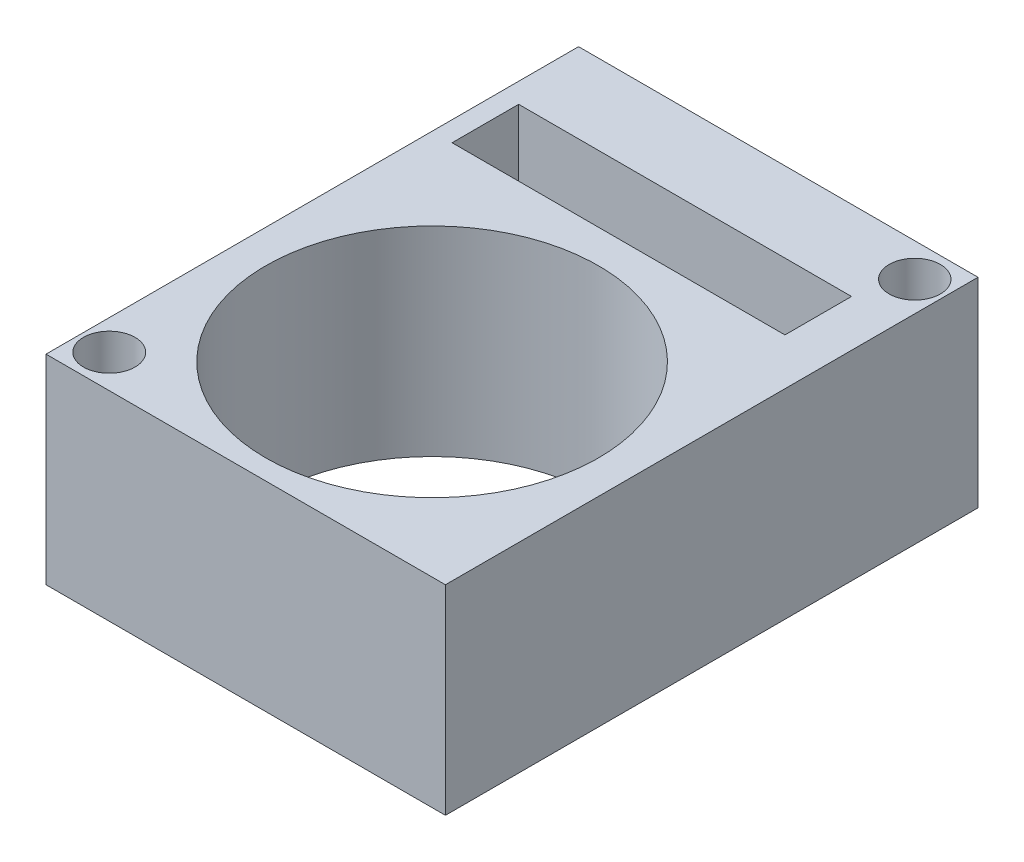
ISO-10303-21;
HEADER;
FILE_DESCRIPTION(('STEP AP214'),'2;1');
FILE_NAME('part.step','',(''),(''),'','','');
FILE_SCHEMA(('AUTOMOTIVE_DESIGN { 1 0 10303 214 1 1 1 1 }'));
ENDSEC;
DATA;
#1=APPLICATION_CONTEXT('core data for automotive mechanical design processes');
#2=APPLICATION_PROTOCOL_DEFINITION('international standard','automotive_design',2000,#1);
#3=PRODUCT_CONTEXT('',#1,'mechanical');
#4=PRODUCT('Part','Part','',(#3));
#5=PRODUCT_RELATED_PRODUCT_CATEGORY('part','',(#4));
#6=PRODUCT_DEFINITION_FORMATION('','',#4);
#7=PRODUCT_DEFINITION_CONTEXT('part definition',#1,'design');
#8=PRODUCT_DEFINITION('design','',#6,#7);
#9=PRODUCT_DEFINITION_SHAPE('','',#8);
#10=(LENGTH_UNIT() NAMED_UNIT(*) SI_UNIT(.MILLI.,.METRE.));
#11=(NAMED_UNIT(*) PLANE_ANGLE_UNIT() SI_UNIT($,.RADIAN.));
#12=(NAMED_UNIT(*) SI_UNIT($,.STERADIAN.) SOLID_ANGLE_UNIT());
#13=UNCERTAINTY_MEASURE_WITH_UNIT(LENGTH_MEASURE(1.E-05),#10,'distance_accuracy_value','');
#14=(GEOMETRIC_REPRESENTATION_CONTEXT(3) GLOBAL_UNCERTAINTY_ASSIGNED_CONTEXT((#13)) GLOBAL_UNIT_ASSIGNED_CONTEXT((#10,
#11,#12)) REPRESENTATION_CONTEXT('',''));
#15=CARTESIAN_POINT('',(0.,0.,0.));
#16=DIRECTION('',(0.,0.,1.));
#17=DIRECTION('',(1.,0.,0.));
#18=AXIS2_PLACEMENT_3D('',#15,#16,#17);
#19=CARTESIAN_POINT('',(-44.5568845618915,38.1,-56.5212331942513));
#20=DIRECTION('',(1.,0.,0.));
#21=DIRECTION('',(0.,0.,-1.));
#22=AXIS2_PLACEMENT_3D('',#19,#20,#21);
#23=PLANE('',#22);
#24=DIRECTION('',(0.,0.,1.));
#25=VECTOR('',#24,1.);
#26=CARTESIAN_POINT('',(-44.5568845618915,0.,-56.5212331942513));
#27=LINE('',#26,#25);
#28=CARTESIAN_POINT('',(-44.5568845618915,0.,-56.5212331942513));
#29=VERTEX_POINT('',#28);
#30=CARTESIAN_POINT('',(-44.5568845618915,0.,45.0787668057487));
#31=VERTEX_POINT('',#30);
#32=EDGE_CURVE('E130',#29,#31,#27,.T.);
#33=ORIENTED_EDGE('',*,*,#32,.T.);
#34=DIRECTION('',(0.,-1.,0.));
#35=VECTOR('',#34,1.);
#36=CARTESIAN_POINT('',(-44.5568845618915,38.1,45.0787668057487));
#37=LINE('',#36,#35);
#38=CARTESIAN_POINT('',(-44.5568845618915,38.1,45.0787668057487));
#39=VERTEX_POINT('',#38);
#40=EDGE_CURVE('E157',#39,#31,#37,.T.);
#41=ORIENTED_EDGE('',*,*,#40,.F.);
#42=DIRECTION('',(0.,0.,1.));
#43=VECTOR('',#42,1.);
#44=CARTESIAN_POINT('',(-44.5568845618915,38.1,-56.5212331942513));
#45=LINE('',#44,#43);
#46=CARTESIAN_POINT('',(-44.5568845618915,38.1,-56.5212331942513));
#47=VERTEX_POINT('',#46);
#48=EDGE_CURVE('E139',#47,#39,#45,.T.);
#49=ORIENTED_EDGE('',*,*,#48,.F.);
#50=DIRECTION('',(0.,-1.,0.));
#51=VECTOR('',#50,1.);
#52=CARTESIAN_POINT('',(-44.5568845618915,38.1,-56.5212331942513));
#53=LINE('',#52,#51);
#54=EDGE_CURVE('E148',#47,#29,#53,.T.);
#55=ORIENTED_EDGE('',*,*,#54,.T.);
#56=EDGE_LOOP('',(#33,#41,#49,#55));
#57=FACE_BOUND('',#56,.T.);
#58=ADVANCED_FACE('F32',(#57),#23,.F.);
#59=CARTESIAN_POINT('',(-44.5568845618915,38.1,45.0787668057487));
#60=DIRECTION('',(0.,0.,-1.));
#61=DIRECTION('',(-1.,0.,0.));
#62=AXIS2_PLACEMENT_3D('',#59,#60,#61);
#63=PLANE('',#62);
#64=DIRECTION('',(1.,0.,0.));
#65=VECTOR('',#64,1.);
#66=CARTESIAN_POINT('',(-44.5568845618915,0.,45.0787668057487));
#67=LINE('',#66,#65);
#68=CARTESIAN_POINT('',(31.6431154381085,0.,45.0787668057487));
#69=VERTEX_POINT('',#68);
#70=EDGE_CURVE('E133',#31,#69,#67,.T.);
#71=ORIENTED_EDGE('',*,*,#70,.T.);
#72=DIRECTION('',(0.,-1.,0.));
#73=VECTOR('',#72,1.);
#74=CARTESIAN_POINT('',(31.6431154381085,38.1,45.0787668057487));
#75=LINE('',#74,#73);
#76=CARTESIAN_POINT('',(31.6431154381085,38.1,45.0787668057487));
#77=VERTEX_POINT('',#76);
#78=EDGE_CURVE('E154',#77,#69,#75,.T.);
#79=ORIENTED_EDGE('',*,*,#78,.F.);
#80=DIRECTION('',(1.,0.,0.));
#81=VECTOR('',#80,1.);
#82=CARTESIAN_POINT('',(-44.5568845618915,38.1,45.0787668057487));
#83=LINE('',#82,#81);
#84=EDGE_CURVE('E142',#39,#77,#83,.T.);
#85=ORIENTED_EDGE('',*,*,#84,.F.);
#86=ORIENTED_EDGE('',*,*,#40,.T.);
#87=EDGE_LOOP('',(#71,#79,#85,#86));
#88=FACE_BOUND('',#87,.T.);
#89=ADVANCED_FACE('F182',(#88),#63,.F.);
#90=CARTESIAN_POINT('',(31.6431154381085,38.1,-56.5212331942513));
#91=DIRECTION('',(-1.,0.,0.));
#92=DIRECTION('',(0.,0.,1.));
#93=AXIS2_PLACEMENT_3D('',#90,#91,#92);
#94=PLANE('',#93);
#95=DIRECTION('',(0.,0.,-1.));
#96=VECTOR('',#95,1.);
#97=CARTESIAN_POINT('',(31.6431154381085,0.,-56.5212331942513));
#98=LINE('',#97,#96);
#99=CARTESIAN_POINT('',(31.6431154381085,0.,-56.5212331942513));
#100=VERTEX_POINT('',#99);
#101=EDGE_CURVE('E135',#69,#100,#98,.T.);
#102=ORIENTED_EDGE('',*,*,#101,.T.);
#103=DIRECTION('',(0.,-1.,0.));
#104=VECTOR('',#103,1.);
#105=CARTESIAN_POINT('',(31.6431154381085,38.1,-56.5212331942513));
#106=LINE('',#105,#104);
#107=CARTESIAN_POINT('',(31.6431154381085,38.1,-56.5212331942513));
#108=VERTEX_POINT('',#107);
#109=EDGE_CURVE('E151',#108,#100,#106,.T.);
#110=ORIENTED_EDGE('',*,*,#109,.F.);
#111=DIRECTION('',(0.,0.,-1.));
#112=VECTOR('',#111,1.);
#113=CARTESIAN_POINT('',(31.6431154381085,38.1,-56.5212331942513));
#114=LINE('',#113,#112);
#115=EDGE_CURVE('E144',#77,#108,#114,.T.);
#116=ORIENTED_EDGE('',*,*,#115,.F.);
#117=ORIENTED_EDGE('',*,*,#78,.T.);
#118=EDGE_LOOP('',(#102,#110,#116,#117));
#119=FACE_BOUND('',#118,.T.);
#120=ADVANCED_FACE('F187',(#119),#94,.F.);
#121=CARTESIAN_POINT('',(-44.5568845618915,38.1,-56.5212331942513));
#122=DIRECTION('',(0.,0.,1.));
#123=DIRECTION('',(1.,0.,0.));
#124=AXIS2_PLACEMENT_3D('',#121,#122,#123);
#125=PLANE('',#124);
#126=DIRECTION('',(-1.,0.,0.));
#127=VECTOR('',#126,1.);
#128=CARTESIAN_POINT('',(-44.5568845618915,0.,-56.5212331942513));
#129=LINE('',#128,#127);
#130=EDGE_CURVE('E137',#100,#29,#129,.T.);
#131=ORIENTED_EDGE('',*,*,#130,.T.);
#132=ORIENTED_EDGE('',*,*,#54,.F.);
#133=DIRECTION('',(-1.,0.,0.));
#134=VECTOR('',#133,1.);
#135=CARTESIAN_POINT('',(-44.5568845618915,38.1,-56.5212331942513));
#136=LINE('',#135,#134);
#137=EDGE_CURVE('E146',#108,#47,#136,.T.);
#138=ORIENTED_EDGE('',*,*,#137,.F.);
#139=ORIENTED_EDGE('',*,*,#109,.T.);
#140=EDGE_LOOP('',(#131,#132,#138,#139));
#141=FACE_BOUND('',#140,.T.);
#142=ADVANCED_FACE('F202',(#141),#125,.F.);
#143=CARTESIAN_POINT('',(-44.5568845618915,38.1,45.0787668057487));
#144=DIRECTION('',(0.,1.,0.));
#145=DIRECTION('',(0.,0.,1.));
#146=AXIS2_PLACEMENT_3D('',#143,#144,#145);
#147=PLANE('',#146);
#148=CARTESIAN_POINT('',(-38.8418845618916,38.1,38.7287668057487));
#149=DIRECTION('',(0.,1.,0.));
#150=DIRECTION('',(0.,0.,1.));
#151=AXIS2_PLACEMENT_3D('',#148,#149,#150);
#152=CIRCLE('',#151,4.91925717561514);
#153=CARTESIAN_POINT('',(-38.8418845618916,38.1,43.6480239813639));
#154=VERTEX_POINT('',#153);
#155=EDGE_CURVE('E227',#154,#154,#152,.T.);
#156=ORIENTED_EDGE('',*,*,#155,.F.);
#157=EDGE_LOOP('',(#156));
#158=FACE_BOUND('',#157,.T.);
#159=CARTESIAN_POINT('',(25.9281154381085,38.1,-50.1712331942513));
#160=DIRECTION('',(0.,1.,0.));
#161=DIRECTION('',(0.,0.,1.));
#162=AXIS2_PLACEMENT_3D('',#159,#160,#161);
#163=CIRCLE('',#162,4.88869425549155);
#164=CARTESIAN_POINT('',(25.9281154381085,38.1,-45.2825389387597));
#165=VERTEX_POINT('',#164);
#166=EDGE_CURVE('E226',#165,#165,#163,.T.);
#167=ORIENTED_EDGE('',*,*,#166,.F.);
#168=EDGE_LOOP('',(#167));
#169=FACE_BOUND('',#168,.T.);
#170=DIRECTION('',(0.,0.,1.));
#171=VECTOR('',#170,1.);
#172=CARTESIAN_POINT('',(-40.7468845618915,38.1,-41.2812331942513));
#173=LINE('',#172,#171);
#174=CARTESIAN_POINT('',(-40.7468845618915,38.1,-41.2812331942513));
#175=VERTEX_POINT('',#174);
#176=CARTESIAN_POINT('',(-40.7468845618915,38.1,-28.5812331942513));
#177=VERTEX_POINT('',#176);
#178=EDGE_CURVE('E46',#175,#177,#173,.T.);
#179=ORIENTED_EDGE('',*,*,#178,.F.);
#180=DIRECTION('',(-1.,0.,0.));
#181=VECTOR('',#180,1.);
#182=CARTESIAN_POINT('',(-40.7468845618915,38.1,-41.2812331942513));
#183=LINE('',#182,#181);
#184=CARTESIAN_POINT('',(22.7531154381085,38.1,-41.2812331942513));
#185=VERTEX_POINT('',#184);
#186=EDGE_CURVE('E115',#185,#175,#183,.T.);
#187=ORIENTED_EDGE('',*,*,#186,.F.);
#188=DIRECTION('',(0.,0.,-1.));
#189=VECTOR('',#188,1.);
#190=CARTESIAN_POINT('',(22.7531154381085,38.1,-41.2812331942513));
#191=LINE('',#190,#189);
#192=CARTESIAN_POINT('',(22.7531154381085,38.1,-28.5812331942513));
#193=VERTEX_POINT('',#192);
#194=EDGE_CURVE('E99',#193,#185,#191,.T.);
#195=ORIENTED_EDGE('',*,*,#194,.F.);
#196=DIRECTION('',(1.,0.,0.));
#197=VECTOR('',#196,1.);
#198=CARTESIAN_POINT('',(-40.7468845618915,38.1,-28.5812331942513));
#199=LINE('',#198,#197);
#200=EDGE_CURVE('E108',#177,#193,#199,.T.);
#201=ORIENTED_EDGE('',*,*,#200,.F.);
#202=EDGE_LOOP('',(#179,#187,#195,#201));
#203=FACE_BOUND('',#202,.T.);
#204=CARTESIAN_POINT('',(-6.45688456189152,38.1,9.51876680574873));
#205=DIRECTION('',(0.,1.,0.));
#206=DIRECTION('',(0.,0.,1.));
#207=AXIS2_PLACEMENT_3D('',#204,#205,#206);
#208=CIRCLE('',#207,31.75);
#209=CARTESIAN_POINT('',(-6.45688456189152,38.1,41.2687668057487));
#210=VERTEX_POINT('',#209);
#211=EDGE_CURVE('E122',#210,#210,#208,.T.);
#212=ORIENTED_EDGE('',*,*,#211,.F.);
#213=EDGE_LOOP('',(#212));
#214=FACE_BOUND('',#213,.T.);
#215=ORIENTED_EDGE('',*,*,#48,.T.);
#216=ORIENTED_EDGE('',*,*,#84,.T.);
#217=ORIENTED_EDGE('',*,*,#115,.T.);
#218=ORIENTED_EDGE('',*,*,#137,.T.);
#219=EDGE_LOOP('',(#215,#216,#217,#218));
#220=FACE_BOUND('',#219,.T.);
#221=ADVANCED_FACE('F112',(#158,#169,#203,#214,#220),#147,.T.);
#222=CARTESIAN_POINT('',(-44.5568845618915,0.,45.0787668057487));
#223=DIRECTION('',(0.,1.,0.));
#224=DIRECTION('',(0.,0.,1.));
#225=AXIS2_PLACEMENT_3D('',#222,#223,#224);
#226=PLANE('',#225);
#227=CARTESIAN_POINT('',(-38.8418845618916,0.,38.7287668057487));
#228=DIRECTION('',(0.,-1.,0.));
#229=DIRECTION('',(1.,0.,0.));
#230=AXIS2_PLACEMENT_3D('',#227,#228,#229);
#231=CIRCLE('',#230,4.91925717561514);
#232=CARTESIAN_POINT('',(-33.9226273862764,0.,38.7287668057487));
#233=VERTEX_POINT('',#232);
#234=EDGE_CURVE('E221',#233,#233,#231,.T.);
#235=ORIENTED_EDGE('',*,*,#234,.F.);
#236=EDGE_LOOP('',(#235));
#237=FACE_BOUND('',#236,.T.);
#238=CARTESIAN_POINT('',(25.9281154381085,0.,-50.1712331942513));
#239=DIRECTION('',(0.,-1.,0.));
#240=DIRECTION('',(1.,0.,0.));
#241=AXIS2_PLACEMENT_3D('',#238,#239,#240);
#242=CIRCLE('',#241,4.88869425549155);
#243=CARTESIAN_POINT('',(30.8168096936,0.,-50.1712331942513));
#244=VERTEX_POINT('',#243);
#245=EDGE_CURVE('E224',#244,#244,#242,.T.);
#246=ORIENTED_EDGE('',*,*,#245,.F.);
#247=EDGE_LOOP('',(#246));
#248=FACE_BOUND('',#247,.T.);
#249=DIRECTION('',(-1.,0.,0.));
#250=VECTOR('',#249,1.);
#251=CARTESIAN_POINT('',(-44.5568845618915,0.,-41.2812331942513));
#252=LINE('',#251,#250);
#253=CARTESIAN_POINT('',(22.7531154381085,0.,-41.2812331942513));
#254=VERTEX_POINT('',#253);
#255=CARTESIAN_POINT('',(-40.7468845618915,0.,-41.2812331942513));
#256=VERTEX_POINT('',#255);
#257=EDGE_CURVE('E39',#254,#256,#252,.T.);
#258=ORIENTED_EDGE('',*,*,#257,.T.);
#259=DIRECTION('',(0.,0.,1.));
#260=VECTOR('',#259,1.);
#261=CARTESIAN_POINT('',(-40.7468845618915,0.,45.0787668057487));
#262=LINE('',#261,#260);
#263=CARTESIAN_POINT('',(-40.7468845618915,0.,-28.5812331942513));
#264=VERTEX_POINT('',#263);
#265=EDGE_CURVE('E11',#256,#264,#262,.T.);
#266=ORIENTED_EDGE('',*,*,#265,.T.);
#267=DIRECTION('',(1.,0.,0.));
#268=VECTOR('',#267,1.);
#269=CARTESIAN_POINT('',(-44.5568845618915,0.,-28.5812331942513));
#270=LINE('',#269,#268);
#271=CARTESIAN_POINT('',(22.7531154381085,0.,-28.5812331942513));
#272=VERTEX_POINT('',#271);
#273=EDGE_CURVE('E160',#264,#272,#270,.T.);
#274=ORIENTED_EDGE('',*,*,#273,.T.);
#275=DIRECTION('',(0.,0.,-1.));
#276=VECTOR('',#275,1.);
#277=CARTESIAN_POINT('',(22.7531154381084,0.,45.0787668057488));
#278=LINE('',#277,#276);
#279=EDGE_CURVE('E102',#272,#254,#278,.T.);
#280=ORIENTED_EDGE('',*,*,#279,.T.);
#281=EDGE_LOOP('',(#258,#266,#274,#280));
#282=FACE_BOUND('',#281,.T.);
#283=CARTESIAN_POINT('',(-6.45688456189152,0.,9.51876680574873));
#284=DIRECTION('',(0.,1.,0.));
#285=DIRECTION('',(0.,0.,1.));
#286=AXIS2_PLACEMENT_3D('',#283,#284,#285);
#287=CIRCLE('',#286,31.75);
#288=CARTESIAN_POINT('',(-6.45688456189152,0.,41.2687668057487));
#289=VERTEX_POINT('',#288);
#290=EDGE_CURVE('E127',#289,#289,#287,.T.);
#291=ORIENTED_EDGE('',*,*,#290,.T.);
#292=EDGE_LOOP('',(#291));
#293=FACE_BOUND('',#292,.T.);
#294=ORIENTED_EDGE('',*,*,#32,.F.);
#295=ORIENTED_EDGE('',*,*,#130,.F.);
#296=ORIENTED_EDGE('',*,*,#101,.F.);
#297=ORIENTED_EDGE('',*,*,#70,.F.);
#298=EDGE_LOOP('',(#294,#295,#296,#297));
#299=FACE_BOUND('',#298,.T.);
#300=ADVANCED_FACE('F164',(#237,#248,#282,#293,#299),#226,.F.);
#301=CARTESIAN_POINT('',(-6.45688456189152,0.,9.51876680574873));
#302=DIRECTION('',(0.,1.,0.));
#303=DIRECTION('',(0.,0.,1.));
#304=AXIS2_PLACEMENT_3D('',#301,#302,#303);
#305=CYLINDRICAL_SURFACE('',#304,31.75);
#306=CARTESIAN_POINT('',(-6.45688456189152,0.,41.2687668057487));
#307=CARTESIAN_POINT('',(-6.45688456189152,0.396875,41.2687668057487));
#308=CARTESIAN_POINT('',(-6.45688456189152,0.79375,41.2687668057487));
#309=CARTESIAN_POINT('',(-6.45688456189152,1.5875,41.2687668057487));
#310=CARTESIAN_POINT('',(-6.45688456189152,1.984375,41.2687668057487));
#311=CARTESIAN_POINT('',(-6.45688456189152,2.778125,41.2687668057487));
#312=CARTESIAN_POINT('',(-6.45688456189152,3.175,41.2687668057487));
#313=CARTESIAN_POINT('',(-6.45688456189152,3.96875,41.2687668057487));
#314=CARTESIAN_POINT('',(-6.45688456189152,4.365625,41.2687668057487));
#315=CARTESIAN_POINT('',(-6.45688456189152,5.159375,41.2687668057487));
#316=CARTESIAN_POINT('',(-6.45688456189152,5.55625,41.2687668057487));
#317=CARTESIAN_POINT('',(-6.45688456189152,6.35,41.2687668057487));
#318=CARTESIAN_POINT('',(-6.45688456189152,6.746875,41.2687668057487));
#319=CARTESIAN_POINT('',(-6.45688456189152,7.540625,41.2687668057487));
#320=CARTESIAN_POINT('',(-6.45688456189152,7.9375,41.2687668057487));
#321=CARTESIAN_POINT('',(-6.45688456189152,8.73125,41.2687668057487));
#322=CARTESIAN_POINT('',(-6.45688456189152,9.128125,41.2687668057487));
#323=CARTESIAN_POINT('',(-6.45688456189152,9.921875,41.2687668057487));
#324=CARTESIAN_POINT('',(-6.45688456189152,10.31875,41.2687668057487));
#325=CARTESIAN_POINT('',(-6.45688456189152,11.1125,41.2687668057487));
#326=CARTESIAN_POINT('',(-6.45688456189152,11.509375,41.2687668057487));
#327=CARTESIAN_POINT('',(-6.45688456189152,12.303125,41.2687668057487));
#328=CARTESIAN_POINT('',(-6.45688456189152,12.7,41.2687668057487));
#329=CARTESIAN_POINT('',(-6.45688456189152,13.49375,41.2687668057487));
#330=CARTESIAN_POINT('',(-6.45688456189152,13.890625,41.2687668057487));
#331=CARTESIAN_POINT('',(-6.45688456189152,14.684375,41.2687668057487));
#332=CARTESIAN_POINT('',(-6.45688456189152,15.08125,41.2687668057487));
#333=CARTESIAN_POINT('',(-6.45688456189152,15.875,41.2687668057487));
#334=CARTESIAN_POINT('',(-6.45688456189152,16.271875,41.2687668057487));
#335=CARTESIAN_POINT('',(-6.45688456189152,17.065625,41.2687668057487));
#336=CARTESIAN_POINT('',(-6.45688456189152,17.4625,41.2687668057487));
#337=CARTESIAN_POINT('',(-6.45688456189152,18.25625,41.2687668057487));
#338=CARTESIAN_POINT('',(-6.45688456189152,18.653125,41.2687668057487));
#339=CARTESIAN_POINT('',(-6.45688456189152,19.446875,41.2687668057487));
#340=CARTESIAN_POINT('',(-6.45688456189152,19.84375,41.2687668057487));
#341=CARTESIAN_POINT('',(-6.45688456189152,20.6375,41.2687668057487));
#342=CARTESIAN_POINT('',(-6.45688456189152,21.034375,41.2687668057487));
#343=CARTESIAN_POINT('',(-6.45688456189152,21.828125,41.2687668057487));
#344=CARTESIAN_POINT('',(-6.45688456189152,22.225,41.2687668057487));
#345=CARTESIAN_POINT('',(-6.45688456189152,23.01875,41.2687668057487));
#346=CARTESIAN_POINT('',(-6.45688456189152,23.415625,41.2687668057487));
#347=CARTESIAN_POINT('',(-6.45688456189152,24.209375,41.2687668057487));
#348=CARTESIAN_POINT('',(-6.45688456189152,24.60625,41.2687668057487));
#349=CARTESIAN_POINT('',(-6.45688456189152,25.4,41.2687668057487));
#350=CARTESIAN_POINT('',(-6.45688456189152,25.796875,41.2687668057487));
#351=CARTESIAN_POINT('',(-6.45688456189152,26.590625,41.2687668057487));
#352=CARTESIAN_POINT('',(-6.45688456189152,26.9875,41.2687668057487));
#353=CARTESIAN_POINT('',(-6.45688456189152,27.78125,41.2687668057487));
#354=CARTESIAN_POINT('',(-6.45688456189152,28.178125,41.2687668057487));
#355=CARTESIAN_POINT('',(-6.45688456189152,28.971875,41.2687668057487));
#356=CARTESIAN_POINT('',(-6.45688456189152,29.36875,41.2687668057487));
#357=CARTESIAN_POINT('',(-6.45688456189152,30.1625,41.2687668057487));
#358=CARTESIAN_POINT('',(-6.45688456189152,30.559375,41.2687668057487));
#359=CARTESIAN_POINT('',(-6.45688456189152,31.353125,41.2687668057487));
#360=CARTESIAN_POINT('',(-6.45688456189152,31.75,41.2687668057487));
#361=CARTESIAN_POINT('',(-6.45688456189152,32.54375,41.2687668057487));
#362=CARTESIAN_POINT('',(-6.45688456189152,32.940625,41.2687668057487));
#363=CARTESIAN_POINT('',(-6.45688456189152,33.734375,41.2687668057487));
#364=CARTESIAN_POINT('',(-6.45688456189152,34.13125,41.2687668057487));
#365=CARTESIAN_POINT('',(-6.45688456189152,34.925,41.2687668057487));
#366=CARTESIAN_POINT('',(-6.45688456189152,35.321875,41.2687668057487));
#367=CARTESIAN_POINT('',(-6.45688456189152,36.115625,41.2687668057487));
#368=CARTESIAN_POINT('',(-6.45688456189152,36.5125,41.2687668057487));
#369=CARTESIAN_POINT('',(-6.45688456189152,37.30625,41.2687668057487));
#370=CARTESIAN_POINT('',(-6.45688456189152,37.703125,41.2687668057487));
#371=CARTESIAN_POINT('',(-6.45688456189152,38.1,41.2687668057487));
#372=B_SPLINE_CURVE_WITH_KNOTS('',3,(#306,#307,#308,#309,#310,#311,#312,#313,#314,#315,#316,
#317,#318,#319,#320,#321,#322,#323,#324,#325,#326,#327,#328,#329,#330,#331,#332,#333,#334,#335,
#336,#337,#338,#339,#340,#341,#342,#343,#344,#345,#346,#347,#348,#349,#350,#351,#352,#353,#354,
#355,#356,#357,#358,#359,#360,#361,#362,#363,#364,#365,#366,#367,#368,#369,#370,#371),
.UNSPECIFIED.,.F.,.F.,(4,2,2,2,2,2,2,2,2,2,2,2,2,2,2,2,2,2,2,2,2,2,2,2,2,2,2,2,2,2,2,2,4),(0.,
1.190625,2.38125,3.571875,4.7625,5.953125,7.14375,8.334375,9.525,10.715625,11.90625,13.096875,
14.2875,15.478125,16.66875,17.859375,19.05,20.240625,21.43125,22.621875,23.8125,25.003125,
26.19375,27.384375,28.575,29.765625,30.95625,32.146875,33.3375,34.528125,35.71875,36.909375,
38.1),.UNSPECIFIED.);
#373=EDGE_CURVE('BSEAM171',#289,#210,#372,.T.);
#374=ORIENTED_EDGE('',*,*,#290,.F.);
#375=ORIENTED_EDGE('',*,*,#211,.T.);
#376=ORIENTED_EDGE('',*,*,#373,.T.);
#377=ORIENTED_EDGE('',*,*,#373,.F.);
#378=EDGE_LOOP('',(#374,#376,#375,#377));
#379=FACE_BOUND('',#378,.T.);
#380=ADVANCED_FACE('F171',(#379),#305,.F.);
#381=CARTESIAN_POINT('',(-40.7468845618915,-12.7,-41.2812331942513));
#382=DIRECTION('',(-1.,0.,0.));
#383=DIRECTION('',(0.,0.,1.));
#384=AXIS2_PLACEMENT_3D('',#381,#382,#383);
#385=PLANE('',#384);
#386=DIRECTION('',(0.,1.,0.));
#387=VECTOR('',#386,1.);
#388=CARTESIAN_POINT('',(-40.7468845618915,-12.7,-41.2812331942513));
#389=LINE('',#388,#387);
#390=EDGE_CURVE('E120',#256,#175,#389,.T.);
#391=ORIENTED_EDGE('',*,*,#390,.T.);
#392=ORIENTED_EDGE('',*,*,#178,.T.);
#393=DIRECTION('',(0.,1.,0.));
#394=VECTOR('',#393,1.);
#395=CARTESIAN_POINT('',(-40.7468845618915,-12.7,-28.5812331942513));
#396=LINE('',#395,#394);
#397=EDGE_CURVE('E105',#264,#177,#396,.T.);
#398=ORIENTED_EDGE('',*,*,#397,.F.);
#399=ORIENTED_EDGE('',*,*,#265,.F.);
#400=EDGE_LOOP('',(#391,#392,#398,#399));
#401=FACE_BOUND('',#400,.T.);
#402=ADVANCED_FACE('F169',(#401),#385,.F.);
#403=CARTESIAN_POINT('',(-40.7468845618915,-12.7,-41.2812331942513));
#404=DIRECTION('',(0.,0.,-1.));
#405=DIRECTION('',(-1.,0.,0.));
#406=AXIS2_PLACEMENT_3D('',#403,#404,#405);
#407=PLANE('',#406);
#408=DIRECTION('',(0.,1.,0.));
#409=VECTOR('',#408,1.);
#410=CARTESIAN_POINT('',(22.7531154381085,-12.7,-41.2812331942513));
#411=LINE('',#410,#409);
#412=EDGE_CURVE('E104',#254,#185,#411,.T.);
#413=ORIENTED_EDGE('',*,*,#412,.T.);
#414=ORIENTED_EDGE('',*,*,#186,.T.);
#415=ORIENTED_EDGE('',*,*,#390,.F.);
#416=ORIENTED_EDGE('',*,*,#257,.F.);
#417=EDGE_LOOP('',(#413,#414,#415,#416));
#418=FACE_BOUND('',#417,.T.);
#419=ADVANCED_FACE('F168',(#418),#407,.F.);
#420=CARTESIAN_POINT('',(22.7531154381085,-12.7,-41.2812331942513));
#421=DIRECTION('',(1.,0.,0.));
#422=DIRECTION('',(0.,0.,-1.));
#423=AXIS2_PLACEMENT_3D('',#420,#421,#422);
#424=PLANE('',#423);
#425=DIRECTION('',(0.,1.,0.));
#426=VECTOR('',#425,1.);
#427=CARTESIAN_POINT('',(22.7531154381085,-12.7,-28.5812331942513));
#428=LINE('',#427,#426);
#429=EDGE_CURVE('E54',#272,#193,#428,.T.);
#430=ORIENTED_EDGE('',*,*,#429,.T.);
#431=ORIENTED_EDGE('',*,*,#194,.T.);
#432=ORIENTED_EDGE('',*,*,#412,.F.);
#433=ORIENTED_EDGE('',*,*,#279,.F.);
#434=EDGE_LOOP('',(#430,#431,#432,#433));
#435=FACE_BOUND('',#434,.T.);
#436=ADVANCED_FACE('F96',(#435),#424,.F.);
#437=CARTESIAN_POINT('',(-40.7468845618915,-12.7,-28.5812331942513));
#438=DIRECTION('',(0.,0.,1.));
#439=DIRECTION('',(1.,0.,0.));
#440=AXIS2_PLACEMENT_3D('',#437,#438,#439);
#441=PLANE('',#440);
#442=ORIENTED_EDGE('',*,*,#397,.T.);
#443=ORIENTED_EDGE('',*,*,#200,.T.);
#444=ORIENTED_EDGE('',*,*,#429,.F.);
#445=ORIENTED_EDGE('',*,*,#273,.F.);
#446=EDGE_LOOP('',(#442,#443,#444,#445));
#447=FACE_BOUND('',#446,.T.);
#448=ADVANCED_FACE('F109',(#447),#441,.F.);
#449=CARTESIAN_POINT('',(25.9281154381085,50.8,-50.1712331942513));
#450=DIRECTION('',(0.,-1.,0.));
#451=DIRECTION('',(0.,0.,-1.));
#452=AXIS2_PLACEMENT_3D('',#449,#450,#451);
#453=CYLINDRICAL_SURFACE('',#452,4.88869425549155);
#454=ORIENTED_EDGE('',*,*,#166,.T.);
#455=EDGE_LOOP('',(#454));
#456=FACE_BOUND('',#455,.T.);
#457=ORIENTED_EDGE('',*,*,#245,.T.);
#458=EDGE_LOOP('',(#457));
#459=FACE_BOUND('',#458,.T.);
#460=ADVANCED_FACE('F237',(#456,#459),#453,.F.);
#461=CARTESIAN_POINT('',(-38.8418845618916,50.8,38.7287668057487));
#462=DIRECTION('',(0.,-1.,0.));
#463=DIRECTION('',(0.,0.,-1.));
#464=AXIS2_PLACEMENT_3D('',#461,#462,#463);
#465=CYLINDRICAL_SURFACE('',#464,4.91925717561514);
#466=ORIENTED_EDGE('',*,*,#155,.T.);
#467=EDGE_LOOP('',(#466));
#468=FACE_BOUND('',#467,.T.);
#469=ORIENTED_EDGE('',*,*,#234,.T.);
#470=EDGE_LOOP('',(#469));
#471=FACE_BOUND('',#470,.T.);
#472=ADVANCED_FACE('F235',(#468,#471),#465,.F.);
#473=CLOSED_SHELL('',(#58,#89,#120,#142,#221,#300,#380,#402,#419,#436,#448,#460,#472));
#474=MANIFOLD_SOLID_BREP('B2',#473);
#475=ADVANCED_BREP_SHAPE_REPRESENTATION('',(#18,#474),#14);
#476=SHAPE_DEFINITION_REPRESENTATION(#9,#475);
ENDSEC;
END-ISO-10303-21;
